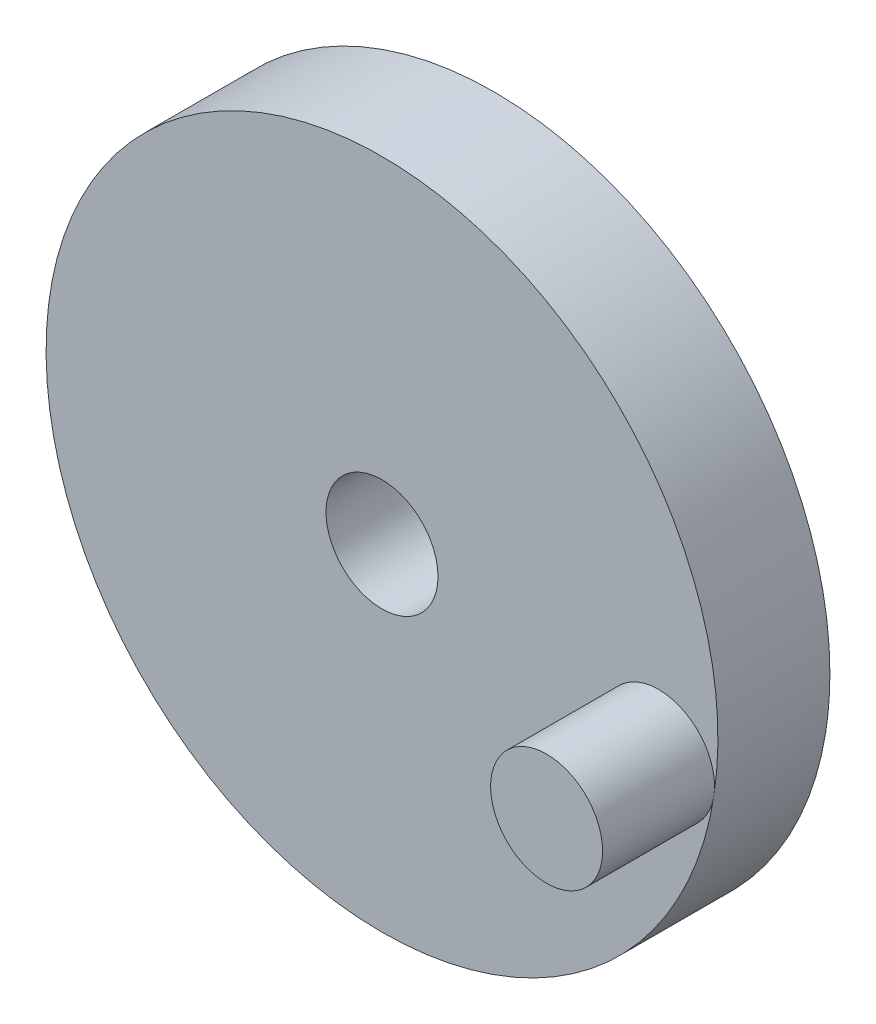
ISO-10303-21;
HEADER;
FILE_DESCRIPTION(('STEP AP214'),'2;1');
FILE_NAME('part.step','',(''),(''),'','','');
FILE_SCHEMA(('AUTOMOTIVE_DESIGN { 1 0 10303 214 1 1 1 1 }'));
ENDSEC;
DATA;
#1=APPLICATION_CONTEXT('core data for automotive mechanical design processes');
#2=APPLICATION_PROTOCOL_DEFINITION('international standard','automotive_design',2000,#1);
#3=PRODUCT_CONTEXT('',#1,'mechanical');
#4=PRODUCT('Part','Part','',(#3));
#5=PRODUCT_RELATED_PRODUCT_CATEGORY('part','',(#4));
#6=PRODUCT_DEFINITION_FORMATION('','',#4);
#7=PRODUCT_DEFINITION_CONTEXT('part definition',#1,'design');
#8=PRODUCT_DEFINITION('design','',#6,#7);
#9=PRODUCT_DEFINITION_SHAPE('','',#8);
#10=(LENGTH_UNIT() NAMED_UNIT(*) SI_UNIT(.MILLI.,.METRE.));
#11=(NAMED_UNIT(*) PLANE_ANGLE_UNIT() SI_UNIT($,.RADIAN.));
#12=(NAMED_UNIT(*) SI_UNIT($,.STERADIAN.) SOLID_ANGLE_UNIT());
#13=UNCERTAINTY_MEASURE_WITH_UNIT(LENGTH_MEASURE(1.E-05),#10,'distance_accuracy_value','');
#14=(GEOMETRIC_REPRESENTATION_CONTEXT(3) GLOBAL_UNCERTAINTY_ASSIGNED_CONTEXT((#13)) GLOBAL_UNIT_ASSIGNED_CONTEXT((#10,
#11,#12)) REPRESENTATION_CONTEXT('',''));
#15=CARTESIAN_POINT('',(0.,0.,0.));
#16=DIRECTION('',(0.,0.,1.));
#17=DIRECTION('',(1.,0.,0.));
#18=AXIS2_PLACEMENT_3D('',#15,#16,#17);
#19=CARTESIAN_POINT('',(0.,0.,10.));
#20=DIRECTION('',(0.,0.,-1.));
#21=DIRECTION('',(-1.,0.,0.));
#22=AXIS2_PLACEMENT_3D('',#19,#20,#21);
#23=CYLINDRICAL_SURFACE('',#22,30.);
#24=CARTESIAN_POINT('',(0.,0.,10.));
#25=DIRECTION('',(0.,0.,1.));
#26=DIRECTION('',(1.,0.,0.));
#27=AXIS2_PLACEMENT_3D('',#24,#25,#26);
#28=CIRCLE('',#27,30.);
#29=CARTESIAN_POINT('',(29.6385206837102,-4.64306920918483,10.));
#30=VERTEX_POINT('',#29);
#31=EDGE_CURVE('E11',#30,#30,#28,.T.);
#32=ORIENTED_EDGE('',*,*,#31,.F.);
#33=EDGE_LOOP('',(#32));
#34=FACE_BOUND('',#33,.T.);
#35=CARTESIAN_POINT('',(0.,0.,0.));
#36=DIRECTION('',(0.,0.,1.));
#37=DIRECTION('',(1.,0.,0.));
#38=AXIS2_PLACEMENT_3D('',#35,#36,#37);
#39=CIRCLE('',#38,30.);
#40=CARTESIAN_POINT('',(30.,0.,0.));
#41=VERTEX_POINT('',#40);
#42=EDGE_CURVE('E37',#41,#41,#39,.T.);
#43=ORIENTED_EDGE('',*,*,#42,.T.);
#44=EDGE_LOOP('',(#43));
#45=FACE_BOUND('',#44,.T.);
#46=ADVANCED_FACE('F34',(#34,#45),#23,.T.);
#47=CARTESIAN_POINT('',(0.,0.,10.));
#48=DIRECTION('',(0.,0.,1.));
#49=DIRECTION('',(1.,0.,0.));
#50=AXIS2_PLACEMENT_3D('',#47,#48,#49);
#51=PLANE('',#50);
#52=CARTESIAN_POINT('',(0.,0.,10.));
#53=DIRECTION('',(0.,0.,1.));
#54=DIRECTION('',(1.,0.,0.));
#55=AXIS2_PLACEMENT_3D('',#52,#53,#54);
#56=CIRCLE('',#55,5.);
#57=CARTESIAN_POINT('',(5.,0.,10.));
#58=VERTEX_POINT('',#57);
#59=EDGE_CURVE('E53',#58,#58,#56,.T.);
#60=ORIENTED_EDGE('',*,*,#59,.F.);
#61=EDGE_LOOP('',(#60));
#62=FACE_BOUND('',#61,.T.);
#63=ORIENTED_EDGE('',*,*,#31,.T.);
#64=CARTESIAN_POINT('',(24.6987672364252,-3.86922434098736,10.));
#65=DIRECTION('',(0.,0.,1.));
#66=DIRECTION('',(1.,0.,0.));
#67=AXIS2_PLACEMENT_3D('',#64,#65,#66);
#68=CIRCLE('',#67,5.);
#69=EDGE_CURVE('E48',#30,#30,#68,.T.);
#70=ORIENTED_EDGE('',*,*,#69,.F.);
#71=EDGE_LOOP('',(#63,#70));
#72=FACE_BOUND('',#71,.T.);
#73=ADVANCED_FACE('F46',(#62,#72),#51,.T.);
#74=CARTESIAN_POINT('',(0.,0.,0.));
#75=DIRECTION('',(0.,0.,1.));
#76=DIRECTION('',(1.,0.,0.));
#77=AXIS2_PLACEMENT_3D('',#74,#75,#76);
#78=PLANE('',#77);
#79=CARTESIAN_POINT('',(0.,0.,0.));
#80=DIRECTION('',(0.,0.,1.));
#81=DIRECTION('',(1.,0.,0.));
#82=AXIS2_PLACEMENT_3D('',#79,#80,#81);
#83=CIRCLE('',#82,5.);
#84=CARTESIAN_POINT('',(5.,0.,0.));
#85=VERTEX_POINT('',#84);
#86=EDGE_CURVE('E56',#85,#85,#83,.T.);
#87=ORIENTED_EDGE('',*,*,#86,.T.);
#88=EDGE_LOOP('',(#87));
#89=FACE_BOUND('',#88,.T.);
#90=ORIENTED_EDGE('',*,*,#42,.F.);
#91=EDGE_LOOP('',(#90));
#92=FACE_BOUND('',#91,.T.);
#93=ADVANCED_FACE('F65',(#89,#92),#78,.F.);
#94=CARTESIAN_POINT('',(0.,0.,0.));
#95=DIRECTION('',(0.,0.,1.));
#96=DIRECTION('',(1.,0.,0.));
#97=AXIS2_PLACEMENT_3D('',#94,#95,#96);
#98=CYLINDRICAL_SURFACE('',#97,5.);
#99=ORIENTED_EDGE('',*,*,#86,.F.);
#100=EDGE_LOOP('',(#99));
#101=FACE_BOUND('',#100,.T.);
#102=ORIENTED_EDGE('',*,*,#59,.T.);
#103=EDGE_LOOP('',(#102));
#104=FACE_BOUND('',#103,.T.);
#105=ADVANCED_FACE('F62',(#101,#104),#98,.F.);
#106=CARTESIAN_POINT('',(24.6987672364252,-3.86922434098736,20.));
#107=DIRECTION('',(0.,0.,-1.));
#108=DIRECTION('',(-1.,0.,0.));
#109=AXIS2_PLACEMENT_3D('',#106,#107,#108);
#110=CYLINDRICAL_SURFACE('',#109,5.);
#111=CARTESIAN_POINT('',(24.6987672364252,-3.86922434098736,20.));
#112=DIRECTION('',(0.,0.,1.));
#113=DIRECTION('',(1.,0.,0.));
#114=AXIS2_PLACEMENT_3D('',#111,#112,#113);
#115=CIRCLE('',#114,5.);
#116=CARTESIAN_POINT('',(29.6987672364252,-3.86922434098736,20.));
#117=VERTEX_POINT('',#116);
#118=EDGE_CURVE('E50',#117,#117,#115,.T.);
#119=ORIENTED_EDGE('',*,*,#118,.F.);
#120=EDGE_LOOP('',(#119));
#121=FACE_BOUND('',#120,.T.);
#122=ORIENTED_EDGE('',*,*,#69,.T.);
#123=EDGE_LOOP('',(#122));
#124=FACE_BOUND('',#123,.T.);
#125=ADVANCED_FACE('F75',(#121,#124),#110,.T.);
#126=CARTESIAN_POINT('',(24.6987672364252,-3.86922434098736,20.));
#127=DIRECTION('',(0.,0.,1.));
#128=DIRECTION('',(1.,0.,0.));
#129=AXIS2_PLACEMENT_3D('',#126,#127,#128);
#130=PLANE('',#129);
#131=ORIENTED_EDGE('',*,*,#118,.T.);
#132=EDGE_LOOP('',(#131));
#133=FACE_BOUND('',#132,.T.);
#134=ADVANCED_FACE('F79',(#133),#130,.T.);
#135=CLOSED_SHELL('',(#46,#73,#93,#105,#125,#134));
#136=MANIFOLD_SOLID_BREP('B2',#135);
#137=ADVANCED_BREP_SHAPE_REPRESENTATION('',(#18,#136),#14);
#138=SHAPE_DEFINITION_REPRESENTATION(#9,#137);
ENDSEC;
END-ISO-10303-21;
